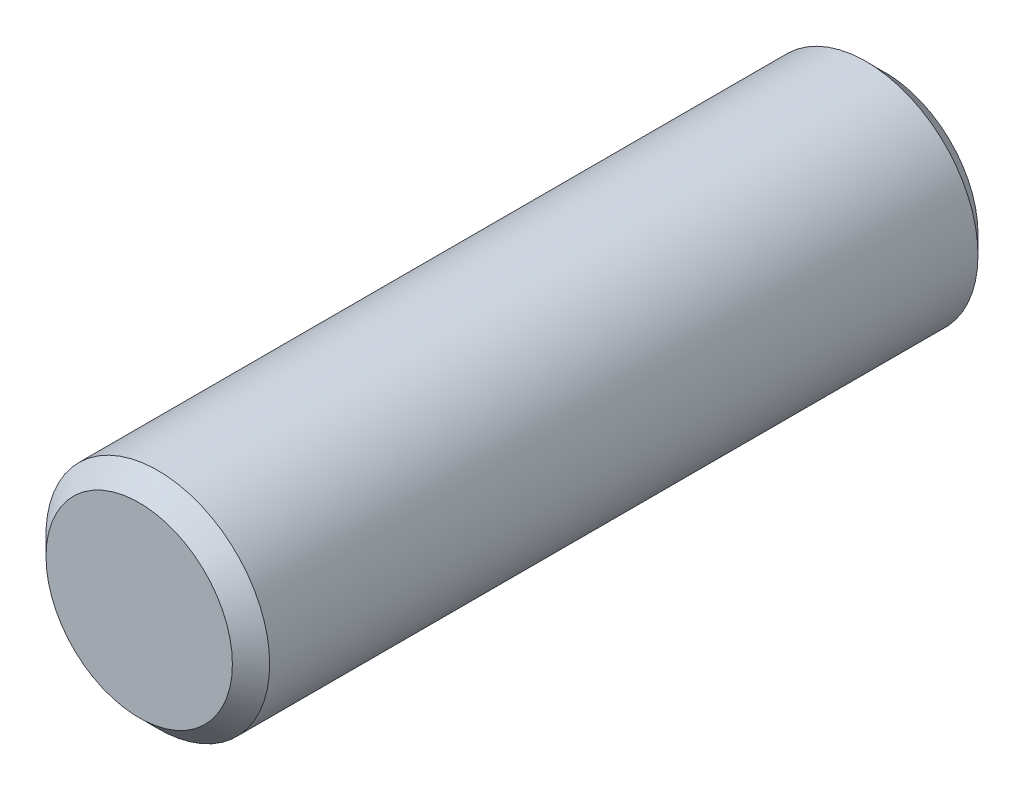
from build123d import *

# Parameters (mm, degrees)
ESQUISSE1_R      = 0.6
EXTRUSION1_DEPTH = 4
CHANFREIN1_SIZE  = 0.1


with BuildPart() as part:
    # Esquisse1 → Extrusion1 (new body)
    with BuildSketch(Plane.XY):
        Circle(ESQUISSE1_R)
    extrude(amount=EXTRUSION1_DEPTH)

    # Chanfrein1
    chanfrein1_edges = [part.edges().sort_by_distance(p)[0] for p in [
        (-0.6, 0, 0),
        (-0.6, 0, 4),
    ]]
    chamfer(chanfrein1_edges, length=CHANFREIN1_SIZE)


solid = part.part
